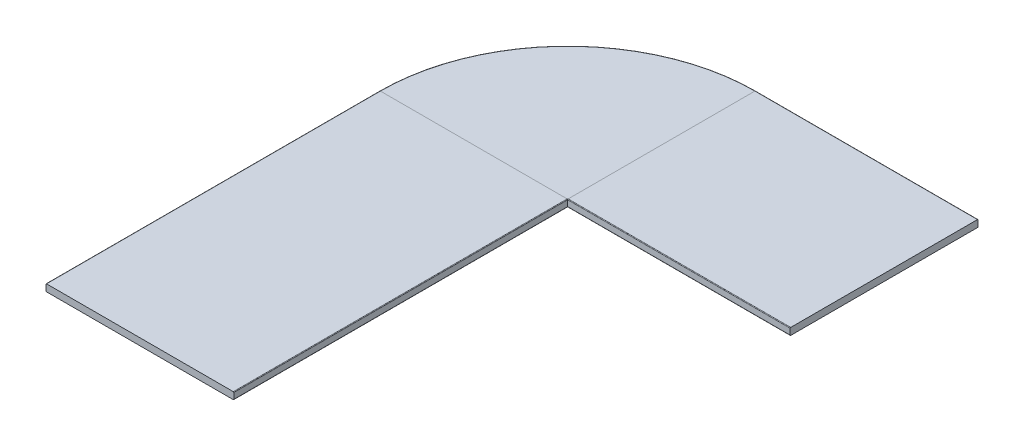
ISO-10303-21;
HEADER;
FILE_DESCRIPTION(('STEP AP214'),'2;1');
FILE_NAME('part.step','',(''),(''),'','','');
FILE_SCHEMA(('AUTOMOTIVE_DESIGN { 1 0 10303 214 1 1 1 1 }'));
ENDSEC;
DATA;
#1=APPLICATION_CONTEXT('core data for automotive mechanical design processes');
#2=APPLICATION_PROTOCOL_DEFINITION('international standard','automotive_design',2000,#1);
#3=PRODUCT_CONTEXT('',#1,'mechanical');
#4=PRODUCT('Part','Part','',(#3));
#5=PRODUCT_RELATED_PRODUCT_CATEGORY('part','',(#4));
#6=PRODUCT_DEFINITION_FORMATION('','',#4);
#7=PRODUCT_DEFINITION_CONTEXT('part definition',#1,'design');
#8=PRODUCT_DEFINITION('design','',#6,#7);
#9=PRODUCT_DEFINITION_SHAPE('','',#8);
#10=(LENGTH_UNIT() NAMED_UNIT(*) SI_UNIT(.MILLI.,.METRE.));
#11=(NAMED_UNIT(*) PLANE_ANGLE_UNIT() SI_UNIT($,.RADIAN.));
#12=(NAMED_UNIT(*) SI_UNIT($,.STERADIAN.) SOLID_ANGLE_UNIT());
#13=UNCERTAINTY_MEASURE_WITH_UNIT(LENGTH_MEASURE(1.E-05),#10,'distance_accuracy_value','');
#14=(GEOMETRIC_REPRESENTATION_CONTEXT(3) GLOBAL_UNCERTAINTY_ASSIGNED_CONTEXT((#13)) GLOBAL_UNIT_ASSIGNED_CONTEXT((#10,
#11,#12)) REPRESENTATION_CONTEXT('',''));
#15=CARTESIAN_POINT('',(0.,0.,0.));
#16=DIRECTION('',(0.,0.,1.));
#17=DIRECTION('',(1.,0.,0.));
#18=AXIS2_PLACEMENT_3D('',#15,#16,#17);
#19=CARTESIAN_POINT('',(685.8,762.,-1219.2));
#20=DIRECTION('',(0.,-1.,0.));
#21=DIRECTION('',(0.,0.,-1.));
#22=AXIS2_PLACEMENT_3D('',#19,#20,#21);
#23=PLANE('',#22);
#24=DIRECTION('',(0.,0.,-1.));
#25=VECTOR('',#24,1.);
#26=CARTESIAN_POINT('',(1498.6,762.,-1905.));
#27=LINE('',#26,#25);
#28=CARTESIAN_POINT('',(1498.6,762.,-1221.232));
#29=VERTEX_POINT('',#28);
#30=CARTESIAN_POINT('',(1498.6,762.,-1902.968));
#31=VERTEX_POINT('',#30);
#32=EDGE_CURVE('E163',#29,#31,#27,.T.);
#33=ORIENTED_EDGE('',*,*,#32,.T.);
#34=DIRECTION('',(-1.,0.,0.));
#35=VECTOR('',#34,1.);
#36=CARTESIAN_POINT('',(685.8,762.,-1902.968));
#37=LINE('',#36,#35);
#38=CARTESIAN_POINT('',(685.8,762.,-1902.968));
#39=VERTEX_POINT('',#38);
#40=EDGE_CURVE('E188',#31,#39,#37,.T.);
#41=ORIENTED_EDGE('',*,*,#40,.T.);
#42=DIRECTION('',(0.,0.,-1.));
#43=VECTOR('',#42,1.);
#44=CARTESIAN_POINT('',(685.8,762.,-1219.2));
#45=LINE('',#44,#43);
#46=CARTESIAN_POINT('',(685.8,762.,-1221.232));
#47=VERTEX_POINT('',#46);
#48=EDGE_CURVE('E182',#47,#39,#45,.T.);
#49=ORIENTED_EDGE('',*,*,#48,.F.);
#50=DIRECTION('',(1.,0.,0.));
#51=VECTOR('',#50,1.);
#52=CARTESIAN_POINT('',(685.8,762.,-1221.232));
#53=LINE('',#52,#51);
#54=EDGE_CURVE('E186',#47,#29,#53,.T.);
#55=ORIENTED_EDGE('',*,*,#54,.T.);
#56=EDGE_LOOP('',(#33,#41,#49,#55));
#57=FACE_BOUND('',#56,.T.);
#58=ADVANCED_FACE('F33',(#57),#23,.F.);
#59=ORIENTED_EDGE('',*,*,#48,.T.);
#60=CARTESIAN_POINT('',(685.8,762.,-1219.2));
#61=DIRECTION('',(0.,-1.,0.));
#62=DIRECTION('',(0.,0.,-1.));
#63=AXIS2_PLACEMENT_3D('',#60,#61,#62);
#64=CIRCLE('',#63,683.768);
#65=CARTESIAN_POINT('',(2.03200000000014,762.,-1219.2));
#66=VERTEX_POINT('',#65);
#67=EDGE_CURVE('E215',#39,#66,#64,.F.);
#68=ORIENTED_EDGE('',*,*,#67,.T.);
#69=DIRECTION('',(-1.,0.,0.));
#70=VECTOR('',#69,1.);
#71=CARTESIAN_POINT('',(685.8,762.,-1219.2));
#72=LINE('',#71,#70);
#73=CARTESIAN_POINT('',(683.768,762.,-1219.2));
#74=VERTEX_POINT('',#73);
#75=EDGE_CURVE('E178',#74,#66,#72,.T.);
#76=ORIENTED_EDGE('',*,*,#75,.F.);
#77=DIRECTION('',(0.,0.,-1.));
#78=VECTOR('',#77,1.);
#79=CARTESIAN_POINT('',(683.768,762.,-1219.2));
#80=LINE('',#79,#78);
#81=CARTESIAN_POINT('',(683.768,762.,-1221.232));
#82=VERTEX_POINT('',#81);
#83=EDGE_CURVE('E213',#74,#82,#80,.T.);
#84=ORIENTED_EDGE('',*,*,#83,.T.);
#85=DIRECTION('',(1.,0.,0.));
#86=VECTOR('',#85,1.);
#87=CARTESIAN_POINT('',(685.8,762.,-1221.232));
#88=LINE('',#87,#86);
#89=EDGE_CURVE('E211',#82,#47,#88,.T.);
#90=ORIENTED_EDGE('',*,*,#89,.T.);
#91=EDGE_LOOP('',(#59,#68,#76,#84,#90));
#92=FACE_BOUND('',#91,.T.);
#93=ADVANCED_FACE('F245',(#92),#23,.F.);
#94=CARTESIAN_POINT('',(685.8,762.,0.));
#95=DIRECTION('',(0.,0.,-1.));
#96=DIRECTION('',(-1.,0.,0.));
#97=AXIS2_PLACEMENT_3D('',#94,#95,#96);
#98=PLANE('',#97);
#99=DIRECTION('',(1.,0.,0.));
#100=VECTOR('',#99,1.);
#101=CARTESIAN_POINT('',(685.8,762.,0.));
#102=LINE('',#101,#100);
#103=CARTESIAN_POINT('',(2.03200000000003,762.,0.));
#104=VERTEX_POINT('',#103);
#105=CARTESIAN_POINT('',(683.768,762.,0.));
#106=VERTEX_POINT('',#105);
#107=EDGE_CURVE('E150',#104,#106,#102,.T.);
#108=ORIENTED_EDGE('',*,*,#107,.F.);
#109=CARTESIAN_POINT('',(2.03200000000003,759.968,0.));
#110=DIRECTION('',(0.,0.,-1.));
#111=DIRECTION('',(-1.,0.,0.));
#112=AXIS2_PLACEMENT_3D('',#109,#110,#111);
#113=CIRCLE('',#112,2.032);
#114=CARTESIAN_POINT('',(0.,759.968,0.));
#115=VERTEX_POINT('',#114);
#116=EDGE_CURVE('E208',#104,#115,#113,.F.);
#117=ORIENTED_EDGE('',*,*,#116,.T.);
#118=DIRECTION('',(0.,-1.,0.));
#119=VECTOR('',#118,1.);
#120=CARTESIAN_POINT('',(0.,762.,0.));
#121=LINE('',#120,#119);
#122=CARTESIAN_POINT('',(0.,736.6,0.));
#123=VERTEX_POINT('',#122);
#124=EDGE_CURVE('E140',#115,#123,#121,.T.);
#125=ORIENTED_EDGE('',*,*,#124,.T.);
#126=DIRECTION('',(1.,0.,0.));
#127=VECTOR('',#126,1.);
#128=CARTESIAN_POINT('',(685.8,736.6,0.));
#129=LINE('',#128,#127);
#130=CARTESIAN_POINT('',(683.768,736.6,0.));
#131=VERTEX_POINT('',#130);
#132=EDGE_CURVE('E149',#123,#131,#129,.T.);
#133=ORIENTED_EDGE('',*,*,#132,.T.);
#134=CARTESIAN_POINT('',(683.768,738.632,0.));
#135=DIRECTION('',(0.,0.,-1.));
#136=DIRECTION('',(-1.,0.,0.));
#137=AXIS2_PLACEMENT_3D('',#134,#135,#136);
#138=CIRCLE('',#137,2.032);
#139=CARTESIAN_POINT('',(685.8,738.632,0.));
#140=VERTEX_POINT('',#139);
#141=EDGE_CURVE('E206',#131,#140,#138,.F.);
#142=ORIENTED_EDGE('',*,*,#141,.T.);
#143=DIRECTION('',(0.,-1.,0.));
#144=VECTOR('',#143,1.);
#145=CARTESIAN_POINT('',(685.8,762.,0.));
#146=LINE('',#145,#144);
#147=CARTESIAN_POINT('',(685.8,759.968,0.));
#148=VERTEX_POINT('',#147);
#149=EDGE_CURVE('E176',#148,#140,#146,.T.);
#150=ORIENTED_EDGE('',*,*,#149,.F.);
#151=CARTESIAN_POINT('',(683.768,759.968,0.));
#152=DIRECTION('',(0.,0.,-1.));
#153=DIRECTION('',(-1.,0.,0.));
#154=AXIS2_PLACEMENT_3D('',#151,#152,#153);
#155=CIRCLE('',#154,2.032);
#156=EDGE_CURVE('E204',#148,#106,#155,.F.);
#157=ORIENTED_EDGE('',*,*,#156,.T.);
#158=EDGE_LOOP('',(#108,#117,#125,#133,#142,#150,#157));
#159=FACE_BOUND('',#158,.T.);
#160=ADVANCED_FACE('F35',(#159),#98,.F.);
#161=CARTESIAN_POINT('',(685.8,762.,-1219.2));
#162=DIRECTION('',(-1.,0.,0.));
#163=DIRECTION('',(0.,0.,1.));
#164=AXIS2_PLACEMENT_3D('',#161,#162,#163);
#165=PLANE('',#164);
#166=ORIENTED_EDGE('',*,*,#149,.T.);
#167=DIRECTION('',(0.,0.,-1.));
#168=VECTOR('',#167,1.);
#169=CARTESIAN_POINT('',(685.8,738.632,-1219.2));
#170=LINE('',#169,#168);
#171=CARTESIAN_POINT('',(685.8,738.632,-1219.2));
#172=VERTEX_POINT('',#171);
#173=EDGE_CURVE('E11',#140,#172,#170,.T.);
#174=ORIENTED_EDGE('',*,*,#173,.T.);
#175=DIRECTION('',(0.,-1.,0.));
#176=VECTOR('',#175,1.);
#177=CARTESIAN_POINT('',(685.8,762.,-1219.2));
#178=LINE('',#177,#176);
#179=CARTESIAN_POINT('',(685.8,759.968,-1219.2));
#180=VERTEX_POINT('',#179);
#181=EDGE_CURVE('E174',#180,#172,#178,.T.);
#182=ORIENTED_EDGE('',*,*,#181,.F.);
#183=DIRECTION('',(0.,0.,-1.));
#184=VECTOR('',#183,1.);
#185=CARTESIAN_POINT('',(685.8,759.968,-1219.2));
#186=LINE('',#185,#184);
#187=EDGE_CURVE('E41',#180,#148,#186,.F.);
#188=ORIENTED_EDGE('',*,*,#187,.T.);
#189=EDGE_LOOP('',(#166,#174,#182,#188));
#190=FACE_BOUND('',#189,.T.);
#191=ADVANCED_FACE('F228',(#190),#165,.F.);
#192=CARTESIAN_POINT('',(1498.6,762.,-1219.2));
#193=DIRECTION('',(0.,0.,-1.));
#194=DIRECTION('',(-1.,0.,0.));
#195=AXIS2_PLACEMENT_3D('',#192,#193,#194);
#196=PLANE('',#195);
#197=ORIENTED_EDGE('',*,*,#181,.T.);
#198=DIRECTION('',(1.,0.,0.));
#199=VECTOR('',#198,1.);
#200=CARTESIAN_POINT('',(1498.6,738.632,-1219.2));
#201=LINE('',#200,#199);
#202=CARTESIAN_POINT('',(1498.6,738.632,-1219.2));
#203=VERTEX_POINT('',#202);
#204=EDGE_CURVE('E221',#172,#203,#201,.T.);
#205=ORIENTED_EDGE('',*,*,#204,.T.);
#206=DIRECTION('',(0.,-1.,0.));
#207=VECTOR('',#206,1.);
#208=CARTESIAN_POINT('',(1498.6,762.,-1219.2));
#209=LINE('',#208,#207);
#210=CARTESIAN_POINT('',(1498.6,759.968,-1219.2));
#211=VERTEX_POINT('',#210);
#212=EDGE_CURVE('E171',#211,#203,#209,.T.);
#213=ORIENTED_EDGE('',*,*,#212,.F.);
#214=DIRECTION('',(1.,0.,0.));
#215=VECTOR('',#214,1.);
#216=CARTESIAN_POINT('',(1498.6,759.968,-1219.2));
#217=LINE('',#216,#215);
#218=EDGE_CURVE('E219',#211,#180,#217,.F.);
#219=ORIENTED_EDGE('',*,*,#218,.T.);
#220=EDGE_LOOP('',(#197,#205,#213,#219));
#221=FACE_BOUND('',#220,.T.);
#222=ADVANCED_FACE('F279',(#221),#196,.F.);
#223=CARTESIAN_POINT('',(1498.6,762.,-1905.));
#224=DIRECTION('',(-1.,0.,0.));
#225=DIRECTION('',(0.,0.,1.));
#226=AXIS2_PLACEMENT_3D('',#223,#224,#225);
#227=PLANE('',#226);
#228=DIRECTION('',(0.,-1.,0.));
#229=VECTOR('',#228,1.);
#230=CARTESIAN_POINT('',(1498.6,762.,-1905.));
#231=LINE('',#230,#229);
#232=CARTESIAN_POINT('',(1498.6,759.968,-1905.));
#233=VERTEX_POINT('',#232);
#234=CARTESIAN_POINT('',(1498.6,736.6,-1905.));
#235=VERTEX_POINT('',#234);
#236=EDGE_CURVE('E168',#233,#235,#231,.T.);
#237=ORIENTED_EDGE('',*,*,#236,.F.);
#238=CARTESIAN_POINT('',(1498.6,759.968,-1902.968));
#239=DIRECTION('',(-1.,0.,0.));
#240=DIRECTION('',(0.,0.,1.));
#241=AXIS2_PLACEMENT_3D('',#238,#239,#240);
#242=CIRCLE('',#241,2.032);
#243=EDGE_CURVE('E197',#233,#31,#242,.F.);
#244=ORIENTED_EDGE('',*,*,#243,.T.);
#245=ORIENTED_EDGE('',*,*,#32,.F.);
#246=CARTESIAN_POINT('',(1498.6,759.968,-1221.232));
#247=DIRECTION('',(-1.,0.,0.));
#248=DIRECTION('',(0.,0.,1.));
#249=AXIS2_PLACEMENT_3D('',#246,#247,#248);
#250=CIRCLE('',#249,2.032);
#251=EDGE_CURVE('E193',#29,#211,#250,.F.);
#252=ORIENTED_EDGE('',*,*,#251,.T.);
#253=ORIENTED_EDGE('',*,*,#212,.T.);
#254=CARTESIAN_POINT('',(1498.6,738.632,-1221.232));
#255=DIRECTION('',(-1.,0.,0.));
#256=DIRECTION('',(0.,0.,1.));
#257=AXIS2_PLACEMENT_3D('',#254,#255,#256);
#258=CIRCLE('',#257,2.032);
#259=CARTESIAN_POINT('',(1498.6,736.6,-1221.232));
#260=VERTEX_POINT('',#259);
#261=EDGE_CURVE('E195',#203,#260,#258,.F.);
#262=ORIENTED_EDGE('',*,*,#261,.T.);
#263=DIRECTION('',(0.,0.,-1.));
#264=VECTOR('',#263,1.);
#265=CARTESIAN_POINT('',(1498.6,736.6,-1219.2));
#266=LINE('',#265,#264);
#267=EDGE_CURVE('E156',#260,#235,#266,.T.);
#268=ORIENTED_EDGE('',*,*,#267,.T.);
#269=EDGE_LOOP('',(#237,#244,#245,#252,#253,#262,#268));
#270=FACE_BOUND('',#269,.T.);
#271=ADVANCED_FACE('F283',(#270),#227,.F.);
#272=CARTESIAN_POINT('',(685.8,762.,-1905.));
#273=DIRECTION('',(0.,0.,1.));
#274=DIRECTION('',(1.,0.,0.));
#275=AXIS2_PLACEMENT_3D('',#272,#273,#274);
#276=PLANE('',#275);
#277=DIRECTION('',(0.,-1.,0.));
#278=VECTOR('',#277,1.);
#279=CARTESIAN_POINT('',(685.8,762.,-1905.));
#280=LINE('',#279,#278);
#281=CARTESIAN_POINT('',(685.8,759.968,-1905.));
#282=VERTEX_POINT('',#281);
#283=CARTESIAN_POINT('',(685.8,736.6,-1905.));
#284=VERTEX_POINT('',#283);
#285=EDGE_CURVE('E139',#282,#284,#280,.T.);
#286=ORIENTED_EDGE('',*,*,#285,.F.);
#287=DIRECTION('',(-1.,0.,0.));
#288=VECTOR('',#287,1.);
#289=CARTESIAN_POINT('',(685.8,759.968,-1905.));
#290=LINE('',#289,#288);
#291=EDGE_CURVE('E191',#282,#233,#290,.F.);
#292=ORIENTED_EDGE('',*,*,#291,.T.);
#293=ORIENTED_EDGE('',*,*,#236,.T.);
#294=DIRECTION('',(-1.,0.,0.));
#295=VECTOR('',#294,1.);
#296=CARTESIAN_POINT('',(685.8,736.6,-1905.));
#297=LINE('',#296,#295);
#298=EDGE_CURVE('E154',#235,#284,#297,.T.);
#299=ORIENTED_EDGE('',*,*,#298,.T.);
#300=EDGE_LOOP('',(#286,#292,#293,#299));
#301=FACE_BOUND('',#300,.T.);
#302=ADVANCED_FACE('F321',(#301),#276,.F.);
#303=CARTESIAN_POINT('',(685.8,762.,-1219.2));
#304=DIRECTION('',(0.,-1.,0.));
#305=DIRECTION('',(0.,0.,-1.));
#306=AXIS2_PLACEMENT_3D('',#303,#304,#305);
#307=CYLINDRICAL_SURFACE('',#306,685.8);
#308=DIRECTION('',(0.,-1.,0.));
#309=VECTOR('',#308,1.);
#310=CARTESIAN_POINT('',(0.,762.,-1219.2));
#311=LINE('',#310,#309);
#312=CARTESIAN_POINT('',(0.,759.968,-1219.2));
#313=VERTEX_POINT('',#312);
#314=CARTESIAN_POINT('',(0.,736.6,-1219.2));
#315=VERTEX_POINT('',#314);
#316=EDGE_CURVE('E129',#313,#315,#311,.T.);
#317=ORIENTED_EDGE('',*,*,#316,.F.);
#318=CARTESIAN_POINT('',(685.8,759.968,-1219.2));
#319=DIRECTION('',(0.,-1.,0.));
#320=DIRECTION('',(0.,0.,-1.));
#321=AXIS2_PLACEMENT_3D('',#318,#319,#320);
#322=CIRCLE('',#321,685.8);
#323=EDGE_CURVE('E217',#313,#282,#322,.T.);
#324=ORIENTED_EDGE('',*,*,#323,.T.);
#325=ORIENTED_EDGE('',*,*,#285,.T.);
#326=CARTESIAN_POINT('',(685.8,736.6,-1219.2));
#327=DIRECTION('',(0.,-1.,0.));
#328=DIRECTION('',(0.,0.,-1.));
#329=AXIS2_PLACEMENT_3D('',#326,#327,#328);
#330=CIRCLE('',#329,685.8);
#331=EDGE_CURVE('E146',#284,#315,#330,.F.);
#332=ORIENTED_EDGE('',*,*,#331,.T.);
#333=EDGE_LOOP('',(#317,#324,#325,#332));
#334=FACE_BOUND('',#333,.T.);
#335=ADVANCED_FACE('F152',(#334),#307,.T.);
#336=CARTESIAN_POINT('',(0.,762.,0.));
#337=DIRECTION('',(1.,0.,0.));
#338=DIRECTION('',(0.,0.,-1.));
#339=AXIS2_PLACEMENT_3D('',#336,#337,#338);
#340=PLANE('',#339);
#341=ORIENTED_EDGE('',*,*,#124,.F.);
#342=DIRECTION('',(0.,0.,1.));
#343=VECTOR('',#342,1.);
#344=CARTESIAN_POINT('',(0.,759.968,0.));
#345=LINE('',#344,#343);
#346=EDGE_CURVE('E135',#115,#313,#345,.F.);
#347=ORIENTED_EDGE('',*,*,#346,.T.);
#348=ORIENTED_EDGE('',*,*,#316,.T.);
#349=DIRECTION('',(0.,0.,1.));
#350=VECTOR('',#349,1.);
#351=CARTESIAN_POINT('',(0.,736.6,-1219.2));
#352=LINE('',#351,#350);
#353=EDGE_CURVE('E133',#315,#123,#352,.T.);
#354=ORIENTED_EDGE('',*,*,#353,.T.);
#355=EDGE_LOOP('',(#341,#347,#348,#354));
#356=FACE_BOUND('',#355,.T.);
#357=ADVANCED_FACE('F132',(#356),#340,.F.);
#358=ORIENTED_EDGE('',*,*,#75,.T.);
#359=DIRECTION('',(0.,0.,1.));
#360=VECTOR('',#359,1.);
#361=CARTESIAN_POINT('',(2.03200000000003,762.,-1219.2));
#362=LINE('',#361,#360);
#363=EDGE_CURVE('E202',#66,#104,#362,.T.);
#364=ORIENTED_EDGE('',*,*,#363,.T.);
#365=ORIENTED_EDGE('',*,*,#107,.T.);
#366=DIRECTION('',(0.,0.,-1.));
#367=VECTOR('',#366,1.);
#368=CARTESIAN_POINT('',(683.768,762.,-1219.2));
#369=LINE('',#368,#367);
#370=EDGE_CURVE('E199',#106,#74,#369,.T.);
#371=ORIENTED_EDGE('',*,*,#370,.T.);
#372=EDGE_LOOP('',(#358,#364,#365,#371));
#373=FACE_BOUND('',#372,.T.);
#374=ADVANCED_FACE('F242',(#373),#23,.F.);
#375=CARTESIAN_POINT('',(685.8,736.6,-1219.2));
#376=DIRECTION('',(0.,-1.,0.));
#377=DIRECTION('',(0.,0.,-1.));
#378=AXIS2_PLACEMENT_3D('',#375,#376,#377);
#379=PLANE('',#378);
#380=ORIENTED_EDGE('',*,*,#267,.F.);
#381=DIRECTION('',(1.,0.,0.));
#382=VECTOR('',#381,1.);
#383=CARTESIAN_POINT('',(685.8,736.6,-1221.232));
#384=LINE('',#383,#382);
#385=CARTESIAN_POINT('',(683.768,736.6,-1221.232));
#386=VERTEX_POINT('',#385);
#387=EDGE_CURVE('E48',#260,#386,#384,.F.);
#388=ORIENTED_EDGE('',*,*,#387,.T.);
#389=DIRECTION('',(0.,0.,-1.));
#390=VECTOR('',#389,1.);
#391=CARTESIAN_POINT('',(683.768,736.6,0.));
#392=LINE('',#391,#390);
#393=EDGE_CURVE('E224',#386,#131,#392,.F.);
#394=ORIENTED_EDGE('',*,*,#393,.T.);
#395=ORIENTED_EDGE('',*,*,#132,.F.);
#396=ORIENTED_EDGE('',*,*,#353,.F.);
#397=ORIENTED_EDGE('',*,*,#331,.F.);
#398=ORIENTED_EDGE('',*,*,#298,.F.);
#399=EDGE_LOOP('',(#380,#388,#394,#395,#396,#397,#398));
#400=FACE_BOUND('',#399,.T.);
#401=ADVANCED_FACE('F144',(#400),#379,.T.);
#402=CARTESIAN_POINT('',(2.03200000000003,759.968,-1219.2));
#403=DIRECTION('',(0.,0.,1.));
#404=DIRECTION('',(1.,0.,0.));
#405=AXIS2_PLACEMENT_3D('',#402,#403,#404);
#406=CYLINDRICAL_SURFACE('',#405,2.032);
#407=ORIENTED_EDGE('',*,*,#116,.F.);
#408=ORIENTED_EDGE('',*,*,#363,.F.);
#409=CARTESIAN_POINT('',(2.032,759.968,-1219.2));
#410=DIRECTION('',(0.,0.,-1.));
#411=DIRECTION('',(-1.,0.,0.));
#412=AXIS2_PLACEMENT_3D('',#409,#410,#411);
#413=CIRCLE('',#412,2.032);
#414=EDGE_CURVE('E255',#313,#66,#413,.T.);
#415=ORIENTED_EDGE('',*,*,#414,.F.);
#416=ORIENTED_EDGE('',*,*,#346,.F.);
#417=EDGE_LOOP('',(#407,#408,#415,#416));
#418=FACE_BOUND('',#417,.T.);
#419=ADVANCED_FACE('F317',(#418),#406,.T.);
#420=CARTESIAN_POINT('',(685.8,759.968,-1219.2));
#421=DIRECTION('',(0.,-1.,0.));
#422=DIRECTION('',(0.,0.,-1.));
#423=AXIS2_PLACEMENT_3D('',#420,#421,#422);
#424=TOROIDAL_SURFACE('',#423,683.768,2.032);
#425=ORIENTED_EDGE('',*,*,#414,.T.);
#426=ORIENTED_EDGE('',*,*,#67,.F.);
#427=CARTESIAN_POINT('',(685.8,759.968,-1902.968));
#428=DIRECTION('',(1.,0.,0.));
#429=DIRECTION('',(0.,0.,-1.));
#430=AXIS2_PLACEMENT_3D('',#427,#428,#429);
#431=CIRCLE('',#430,2.032);
#432=EDGE_CURVE('E254',#282,#39,#431,.T.);
#433=ORIENTED_EDGE('',*,*,#432,.F.);
#434=ORIENTED_EDGE('',*,*,#323,.F.);
#435=EDGE_LOOP('',(#425,#426,#433,#434));
#436=FACE_BOUND('',#435,.T.);
#437=ADVANCED_FACE('F252',(#436),#424,.T.);
#438=CARTESIAN_POINT('',(685.8,759.968,-1902.968));
#439=DIRECTION('',(-1.,0.,0.));
#440=DIRECTION('',(0.,0.,1.));
#441=AXIS2_PLACEMENT_3D('',#438,#439,#440);
#442=CYLINDRICAL_SURFACE('',#441,2.032);
#443=ORIENTED_EDGE('',*,*,#243,.F.);
#444=ORIENTED_EDGE('',*,*,#291,.F.);
#445=ORIENTED_EDGE('',*,*,#432,.T.);
#446=ORIENTED_EDGE('',*,*,#40,.F.);
#447=EDGE_LOOP('',(#443,#444,#445,#446));
#448=FACE_BOUND('',#447,.T.);
#449=ADVANCED_FACE('F262',(#448),#442,.T.);
#450=CARTESIAN_POINT('',(683.768,738.632,-1219.2));
#451=DIRECTION('',(0.,0.,1.));
#452=DIRECTION('',(1.,0.,0.));
#453=AXIS2_PLACEMENT_3D('',#450,#451,#452);
#454=CYLINDRICAL_SURFACE('',#453,2.032);
#455=ORIENTED_EDGE('',*,*,#141,.F.);
#456=ORIENTED_EDGE('',*,*,#393,.F.);
#457=CARTESIAN_POINT('',(683.768,738.632,-1221.232));
#458=DIRECTION('',(-0.707106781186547,0.,0.707106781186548));
#459=DIRECTION('',(-0.707106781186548,0.,-0.707106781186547));
#460=AXIS2_PLACEMENT_3D('',#457,#458,#459);
#461=ELLIPSE('',#460,2.87368195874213,2.032);
#462=EDGE_CURVE('E264',#172,#386,#461,.F.);
#463=ORIENTED_EDGE('',*,*,#462,.F.);
#464=ORIENTED_EDGE('',*,*,#173,.F.);
#465=EDGE_LOOP('',(#455,#456,#463,#464));
#466=FACE_BOUND('',#465,.T.);
#467=ADVANCED_FACE('F272',(#466),#454,.T.);
#468=CARTESIAN_POINT('',(1498.6,738.632,-1221.232));
#469=DIRECTION('',(-1.,0.,0.));
#470=DIRECTION('',(0.,0.,1.));
#471=AXIS2_PLACEMENT_3D('',#468,#469,#470);
#472=CYLINDRICAL_SURFACE('',#471,2.032);
#473=ORIENTED_EDGE('',*,*,#462,.T.);
#474=ORIENTED_EDGE('',*,*,#387,.F.);
#475=ORIENTED_EDGE('',*,*,#261,.F.);
#476=ORIENTED_EDGE('',*,*,#204,.F.);
#477=EDGE_LOOP('',(#473,#474,#475,#476));
#478=FACE_BOUND('',#477,.T.);
#479=ADVANCED_FACE('F276',(#478),#472,.T.);
#480=CARTESIAN_POINT('',(685.8,759.968,-1221.232));
#481=DIRECTION('',(1.,0.,0.));
#482=DIRECTION('',(0.,0.,-1.));
#483=AXIS2_PLACEMENT_3D('',#480,#481,#482);
#484=CYLINDRICAL_SURFACE('',#483,2.032);
#485=ORIENTED_EDGE('',*,*,#251,.F.);
#486=ORIENTED_EDGE('',*,*,#54,.F.);
#487=CARTESIAN_POINT('',(685.8,759.968,-1221.232));
#488=DIRECTION('',(-1.,0.,0.));
#489=DIRECTION('',(0.,0.,1.));
#490=AXIS2_PLACEMENT_3D('',#487,#488,#489);
#491=CIRCLE('',#490,2.032);
#492=EDGE_CURVE('E268',#180,#47,#491,.T.);
#493=ORIENTED_EDGE('',*,*,#492,.F.);
#494=ORIENTED_EDGE('',*,*,#218,.F.);
#495=EDGE_LOOP('',(#485,#486,#493,#494));
#496=FACE_BOUND('',#495,.T.);
#497=ADVANCED_FACE('F286',(#496),#484,.T.);
#498=CARTESIAN_POINT('',(685.8,759.968,-1221.232));
#499=DIRECTION('',(1.,0.,0.));
#500=DIRECTION('',(0.,0.,-1.));
#501=AXIS2_PLACEMENT_3D('',#498,#499,#500);
#502=CYLINDRICAL_SURFACE('',#501,2.032);
#503=ORIENTED_EDGE('',*,*,#492,.T.);
#504=ORIENTED_EDGE('',*,*,#89,.F.);
#505=CARTESIAN_POINT('',(683.768,759.968,-1221.232));
#506=DIRECTION('',(0.707106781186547,0.,-0.707106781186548));
#507=DIRECTION('',(-0.707106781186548,0.,-0.707106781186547));
#508=AXIS2_PLACEMENT_3D('',#505,#506,#507);
#509=ELLIPSE('',#508,2.87368195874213,2.032);
#510=EDGE_CURVE('E290',#180,#82,#509,.F.);
#511=ORIENTED_EDGE('',*,*,#510,.F.);
#512=EDGE_LOOP('',(#503,#504,#511));
#513=FACE_BOUND('',#512,.T.);
#514=ADVANCED_FACE('F292',(#513),#502,.T.);
#515=CARTESIAN_POINT('',(683.768,759.968,-1219.2));
#516=DIRECTION('',(0.,0.,-1.));
#517=DIRECTION('',(-1.,0.,0.));
#518=AXIS2_PLACEMENT_3D('',#515,#516,#517);
#519=CYLINDRICAL_SURFACE('',#518,2.032);
#520=ORIENTED_EDGE('',*,*,#510,.T.);
#521=ORIENTED_EDGE('',*,*,#83,.F.);
#522=CARTESIAN_POINT('',(683.768,759.968,-1219.2));
#523=DIRECTION('',(0.,0.,1.));
#524=DIRECTION('',(1.,0.,0.));
#525=AXIS2_PLACEMENT_3D('',#522,#523,#524);
#526=CIRCLE('',#525,2.032);
#527=EDGE_CURVE('E238',#180,#74,#526,.T.);
#528=ORIENTED_EDGE('',*,*,#527,.F.);
#529=EDGE_LOOP('',(#520,#521,#528));
#530=FACE_BOUND('',#529,.T.);
#531=ADVANCED_FACE('F296',(#530),#519,.T.);
#532=CARTESIAN_POINT('',(683.768,759.968,-1219.2));
#533=DIRECTION('',(0.,0.,-1.));
#534=DIRECTION('',(-1.,0.,0.));
#535=AXIS2_PLACEMENT_3D('',#532,#533,#534);
#536=CYLINDRICAL_SURFACE('',#535,2.032);
#537=ORIENTED_EDGE('',*,*,#156,.F.);
#538=ORIENTED_EDGE('',*,*,#187,.F.);
#539=ORIENTED_EDGE('',*,*,#527,.T.);
#540=ORIENTED_EDGE('',*,*,#370,.F.);
#541=EDGE_LOOP('',(#537,#538,#539,#540));
#542=FACE_BOUND('',#541,.T.);
#543=ADVANCED_FACE('F237',(#542),#536,.T.);
#544=CLOSED_SHELL('',(#58,#93,#160,#191,#222,#271,#302,#335,#357,#374,#401,#419,#437,#449,#467,
#479,#497,#514,#531,#543));
#545=MANIFOLD_SOLID_BREP('B2',#544);
#546=ADVANCED_BREP_SHAPE_REPRESENTATION('',(#18,#545),#14);
#547=SHAPE_DEFINITION_REPRESENTATION(#9,#546);
ENDSEC;
END-ISO-10303-21;
